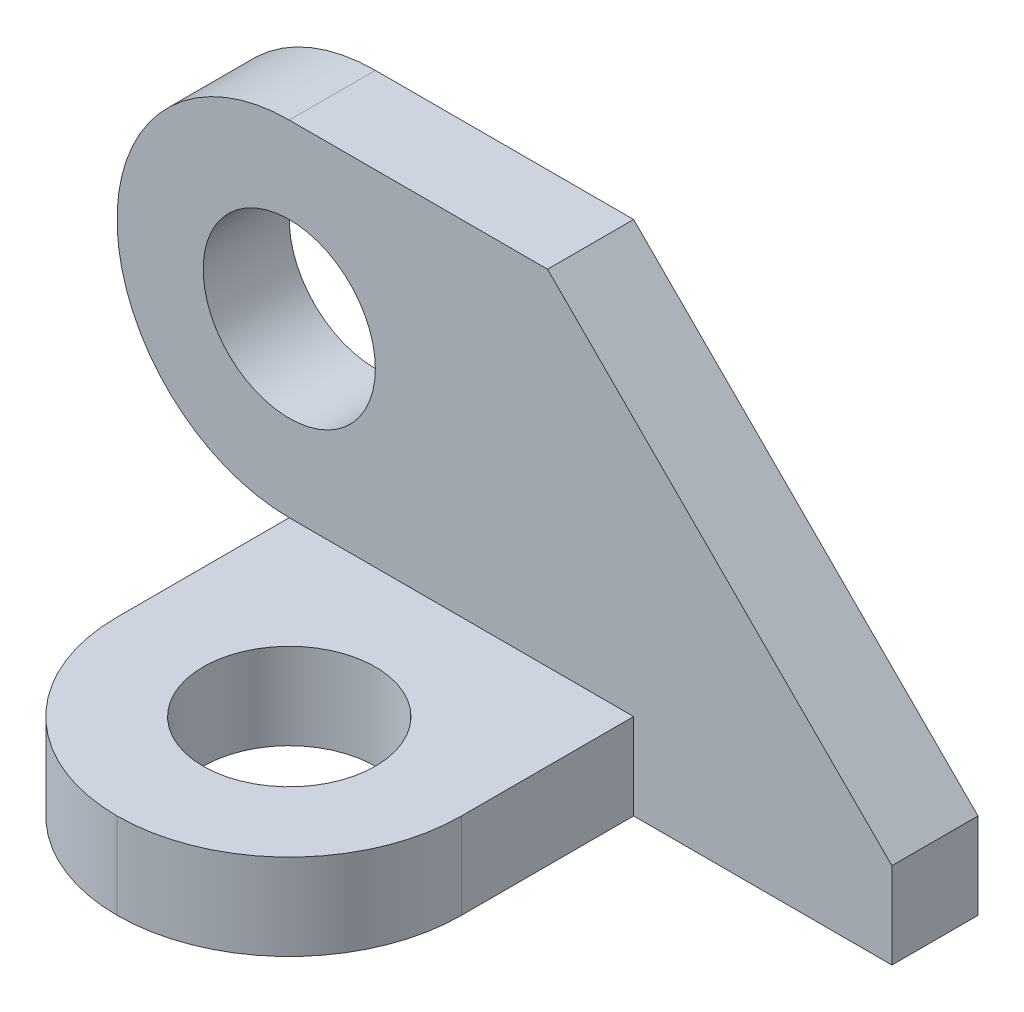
ISO-10303-21;
HEADER;
FILE_DESCRIPTION(('STEP AP214'),'2;1');
FILE_NAME('part.step','',(''),(''),'','','');
FILE_SCHEMA(('AUTOMOTIVE_DESIGN { 1 0 10303 214 1 1 1 1 }'));
ENDSEC;
DATA;
#1=APPLICATION_CONTEXT('core data for automotive mechanical design processes');
#2=APPLICATION_PROTOCOL_DEFINITION('international standard','automotive_design',2000,#1);
#3=PRODUCT_CONTEXT('',#1,'mechanical');
#4=PRODUCT('Part','Part','',(#3));
#5=PRODUCT_RELATED_PRODUCT_CATEGORY('part','',(#4));
#6=PRODUCT_DEFINITION_FORMATION('','',#4);
#7=PRODUCT_DEFINITION_CONTEXT('part definition',#1,'design');
#8=PRODUCT_DEFINITION('design','',#6,#7);
#9=PRODUCT_DEFINITION_SHAPE('','',#8);
#10=(LENGTH_UNIT() NAMED_UNIT(*) SI_UNIT(.MILLI.,.METRE.));
#11=(NAMED_UNIT(*) PLANE_ANGLE_UNIT() SI_UNIT($,.RADIAN.));
#12=(NAMED_UNIT(*) SI_UNIT($,.STERADIAN.) SOLID_ANGLE_UNIT());
#13=UNCERTAINTY_MEASURE_WITH_UNIT(LENGTH_MEASURE(1.E-05),#10,'distance_accuracy_value','');
#14=(GEOMETRIC_REPRESENTATION_CONTEXT(3) GLOBAL_UNCERTAINTY_ASSIGNED_CONTEXT((#13)) GLOBAL_UNIT_ASSIGNED_CONTEXT((#10,
#11,#12)) REPRESENTATION_CONTEXT('',''));
#15=CARTESIAN_POINT('',(0.,0.,0.));
#16=DIRECTION('',(0.,0.,1.));
#17=DIRECTION('',(1.,0.,0.));
#18=AXIS2_PLACEMENT_3D('',#15,#16,#17);
#19=CARTESIAN_POINT('',(0.,30.,0.));
#20=DIRECTION('',(0.,0.,-1.));
#21=DIRECTION('',(-1.,0.,0.));
#22=AXIS2_PLACEMENT_3D('',#19,#20,#21);
#23=PLANE('',#22);
#24=CARTESIAN_POINT('',(0.,30.,0.));
#25=DIRECTION('',(0.,0.,1.));
#26=DIRECTION('',(1.,0.,0.));
#27=AXIS2_PLACEMENT_3D('',#24,#25,#26);
#28=CIRCLE('',#27,10.);
#29=CARTESIAN_POINT('',(10.,30.,0.));
#30=VERTEX_POINT('',#29);
#31=EDGE_CURVE('E167',#30,#30,#28,.T.);
#32=ORIENTED_EDGE('',*,*,#31,.F.);
#33=EDGE_LOOP('',(#32));
#34=FACE_BOUND('',#33,.T.);
#35=DIRECTION('',(-1.,0.,0.));
#36=VECTOR('',#35,1.);
#37=CARTESIAN_POINT('',(0.,10.,0.));
#38=LINE('',#37,#36);
#39=CARTESIAN_POINT('',(40.,10.,0.));
#40=VERTEX_POINT('',#39);
#41=CARTESIAN_POINT('',(0.,10.,0.));
#42=VERTEX_POINT('',#41);
#43=EDGE_CURVE('E108',#40,#42,#38,.T.);
#44=ORIENTED_EDGE('',*,*,#43,.F.);
#45=DIRECTION('',(0.,-1.,0.));
#46=VECTOR('',#45,1.);
#47=CARTESIAN_POINT('',(40.,10.,0.));
#48=LINE('',#47,#46);
#49=CARTESIAN_POINT('',(40.,0.,0.));
#50=VERTEX_POINT('',#49);
#51=EDGE_CURVE('E116',#40,#50,#48,.T.);
#52=ORIENTED_EDGE('',*,*,#51,.T.);
#53=DIRECTION('',(1.,0.,0.));
#54=VECTOR('',#53,1.);
#55=CARTESIAN_POINT('',(70.,0.,0.));
#56=LINE('',#55,#54);
#57=CARTESIAN_POINT('',(70.,0.,0.));
#58=VERTEX_POINT('',#57);
#59=EDGE_CURVE('E122',#50,#58,#56,.T.);
#60=ORIENTED_EDGE('',*,*,#59,.T.);
#61=DIRECTION('',(0.,1.,0.));
#62=VECTOR('',#61,1.);
#63=CARTESIAN_POINT('',(70.,10.,0.));
#64=LINE('',#63,#62);
#65=CARTESIAN_POINT('',(70.,10.,0.));
#66=VERTEX_POINT('',#65);
#67=EDGE_CURVE('E199',#58,#66,#64,.T.);
#68=ORIENTED_EDGE('',*,*,#67,.T.);
#69=DIRECTION('',(-0.707106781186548,0.707106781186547,0.));
#70=VECTOR('',#69,1.);
#71=CARTESIAN_POINT('',(30.,50.,0.));
#72=LINE('',#71,#70);
#73=CARTESIAN_POINT('',(30.,50.,0.));
#74=VERTEX_POINT('',#73);
#75=EDGE_CURVE('E202',#66,#74,#72,.T.);
#76=ORIENTED_EDGE('',*,*,#75,.T.);
#77=DIRECTION('',(-1.,0.,0.));
#78=VECTOR('',#77,1.);
#79=CARTESIAN_POINT('',(0.,50.,0.));
#80=LINE('',#79,#78);
#81=CARTESIAN_POINT('',(0.,50.,0.));
#82=VERTEX_POINT('',#81);
#83=EDGE_CURVE('E205',#74,#82,#80,.T.);
#84=ORIENTED_EDGE('',*,*,#83,.T.);
#85=CARTESIAN_POINT('',(0.,30.,0.));
#86=DIRECTION('',(0.,0.,1.));
#87=DIRECTION('',(-1.,0.,0.));
#88=AXIS2_PLACEMENT_3D('',#85,#86,#87);
#89=CIRCLE('',#88,20.);
#90=EDGE_CURVE('E127',#82,#42,#89,.T.);
#91=ORIENTED_EDGE('',*,*,#90,.T.);
#92=EDGE_LOOP('',(#44,#52,#60,#68,#76,#84,#91));
#93=FACE_BOUND('',#92,.T.);
#94=ADVANCED_FACE('F31',(#34,#93),#23,.F.);
#95=CARTESIAN_POINT('',(70.,0.,-10.));
#96=DIRECTION('',(0.,-1.,0.));
#97=DIRECTION('',(1.,0.,0.));
#98=AXIS2_PLACEMENT_3D('',#95,#96,#97);
#99=PLANE('',#98);
#100=CARTESIAN_POINT('',(20.,0.,20.));
#101=DIRECTION('',(0.,1.,0.));
#102=DIRECTION('',(0.,0.,1.));
#103=AXIS2_PLACEMENT_3D('',#100,#101,#102);
#104=CIRCLE('',#103,10.);
#105=CARTESIAN_POINT('',(20.,0.,30.));
#106=VERTEX_POINT('',#105);
#107=EDGE_CURVE('E157',#106,#106,#104,.T.);
#108=ORIENTED_EDGE('',*,*,#107,.T.);
#109=EDGE_LOOP('',(#108));
#110=FACE_BOUND('',#109,.T.);
#111=DIRECTION('',(0.,0.,-1.));
#112=VECTOR('',#111,1.);
#113=CARTESIAN_POINT('',(40.,0.,0.));
#114=LINE('',#113,#112);
#115=CARTESIAN_POINT('',(40.,0.,20.));
#116=VERTEX_POINT('',#115);
#117=EDGE_CURVE('E119',#116,#50,#114,.T.);
#118=ORIENTED_EDGE('',*,*,#117,.F.);
#119=CARTESIAN_POINT('',(20.,0.,20.));
#120=DIRECTION('',(0.,-1.,0.));
#121=DIRECTION('',(1.,0.,0.));
#122=AXIS2_PLACEMENT_3D('',#119,#120,#121);
#123=CIRCLE('',#122,20.);
#124=CARTESIAN_POINT('',(20.,0.,40.));
#125=VERTEX_POINT('',#124);
#126=EDGE_CURVE('E147',#116,#125,#123,.T.);
#127=ORIENTED_EDGE('',*,*,#126,.T.);
#128=CARTESIAN_POINT('',(20.,0.,20.));
#129=DIRECTION('',(0.,-1.,0.));
#130=DIRECTION('',(1.,0.,0.));
#131=AXIS2_PLACEMENT_3D('',#128,#129,#130);
#132=CIRCLE('',#131,20.);
#133=CARTESIAN_POINT('',(0.,0.,20.));
#134=VERTEX_POINT('',#133);
#135=EDGE_CURVE('E144',#125,#134,#132,.T.);
#136=ORIENTED_EDGE('',*,*,#135,.T.);
#137=DIRECTION('',(0.,0.,1.));
#138=VECTOR('',#137,1.);
#139=CARTESIAN_POINT('',(0.,0.,-10.));
#140=LINE('',#139,#138);
#141=CARTESIAN_POINT('',(0.,0.,-10.));
#142=VERTEX_POINT('',#141);
#143=EDGE_CURVE('E145',#142,#134,#140,.T.);
#144=ORIENTED_EDGE('',*,*,#143,.F.);
#145=DIRECTION('',(1.,0.,0.));
#146=VECTOR('',#145,1.);
#147=CARTESIAN_POINT('',(70.,0.,-10.));
#148=LINE('',#147,#146);
#149=CARTESIAN_POINT('',(70.,0.,-10.));
#150=VERTEX_POINT('',#149);
#151=EDGE_CURVE('E133',#142,#150,#148,.T.);
#152=ORIENTED_EDGE('',*,*,#151,.T.);
#153=DIRECTION('',(0.,0.,1.));
#154=VECTOR('',#153,1.);
#155=CARTESIAN_POINT('',(70.,0.,-10.));
#156=LINE('',#155,#154);
#157=EDGE_CURVE('E188',#150,#58,#156,.T.);
#158=ORIENTED_EDGE('',*,*,#157,.T.);
#159=ORIENTED_EDGE('',*,*,#59,.F.);
#160=EDGE_LOOP('',(#118,#127,#136,#144,#152,#158,#159));
#161=FACE_BOUND('',#160,.T.);
#162=ADVANCED_FACE('F152',(#110,#161),#99,.T.);
#163=CARTESIAN_POINT('',(0.,0.,-10.));
#164=DIRECTION('',(-1.,0.,0.));
#165=DIRECTION('',(0.,0.,1.));
#166=AXIS2_PLACEMENT_3D('',#163,#164,#165);
#167=PLANE('',#166);
#168=ORIENTED_EDGE('',*,*,#143,.T.);
#169=DIRECTION('',(0.,-1.,0.));
#170=VECTOR('',#169,1.);
#171=CARTESIAN_POINT('',(0.,10.,20.));
#172=LINE('',#171,#170);
#173=CARTESIAN_POINT('',(0.,10.,20.));
#174=VERTEX_POINT('',#173);
#175=EDGE_CURVE('E11',#134,#174,#172,.F.);
#176=ORIENTED_EDGE('',*,*,#175,.T.);
#177=DIRECTION('',(0.,0.,1.));
#178=VECTOR('',#177,1.);
#179=CARTESIAN_POINT('',(0.,10.,0.));
#180=LINE('',#179,#178);
#181=EDGE_CURVE('E113',#42,#174,#180,.T.);
#182=ORIENTED_EDGE('',*,*,#181,.F.);
#183=DIRECTION('',(0.,0.,1.));
#184=VECTOR('',#183,1.);
#185=CARTESIAN_POINT('',(0.,10.,-10.));
#186=LINE('',#185,#184);
#187=CARTESIAN_POINT('',(0.,10.,-10.));
#188=VERTEX_POINT('',#187);
#189=EDGE_CURVE('E172',#188,#42,#186,.T.);
#190=ORIENTED_EDGE('',*,*,#189,.F.);
#191=DIRECTION('',(0.,-1.,0.));
#192=VECTOR('',#191,1.);
#193=CARTESIAN_POINT('',(0.,0.,-10.));
#194=LINE('',#193,#192);
#195=EDGE_CURVE('E190',#188,#142,#194,.T.);
#196=ORIENTED_EDGE('',*,*,#195,.T.);
#197=EDGE_LOOP('',(#168,#176,#182,#190,#196));
#198=FACE_BOUND('',#197,.T.);
#199=ADVANCED_FACE('F170',(#198),#167,.T.);
#200=CARTESIAN_POINT('',(0.,30.,-10.));
#201=DIRECTION('',(0.,0.,1.));
#202=DIRECTION('',(1.,0.,0.));
#203=AXIS2_PLACEMENT_3D('',#200,#201,#202);
#204=CYLINDRICAL_SURFACE('',#203,20.);
#205=ORIENTED_EDGE('',*,*,#90,.F.);
#206=DIRECTION('',(0.,0.,1.));
#207=VECTOR('',#206,1.);
#208=CARTESIAN_POINT('',(0.,50.,-10.));
#209=LINE('',#208,#207);
#210=CARTESIAN_POINT('',(0.,50.,-10.));
#211=VERTEX_POINT('',#210);
#212=EDGE_CURVE('E179',#211,#82,#209,.T.);
#213=ORIENTED_EDGE('',*,*,#212,.F.);
#214=CARTESIAN_POINT('',(0.,30.,-10.));
#215=DIRECTION('',(0.,0.,1.));
#216=DIRECTION('',(-1.,0.,0.));
#217=AXIS2_PLACEMENT_3D('',#214,#215,#216);
#218=CIRCLE('',#217,20.);
#219=EDGE_CURVE('E177',#211,#188,#218,.T.);
#220=ORIENTED_EDGE('',*,*,#219,.T.);
#221=ORIENTED_EDGE('',*,*,#189,.T.);
#222=EDGE_LOOP('',(#205,#213,#220,#221));
#223=FACE_BOUND('',#222,.T.);
#224=ADVANCED_FACE('F175',(#223),#204,.T.);
#225=CARTESIAN_POINT('',(0.,50.,-10.));
#226=DIRECTION('',(0.,1.,0.));
#227=DIRECTION('',(0.,0.,1.));
#228=AXIS2_PLACEMENT_3D('',#225,#226,#227);
#229=PLANE('',#228);
#230=ORIENTED_EDGE('',*,*,#83,.F.);
#231=DIRECTION('',(0.,0.,1.));
#232=VECTOR('',#231,1.);
#233=CARTESIAN_POINT('',(30.,50.,-10.));
#234=LINE('',#233,#232);
#235=CARTESIAN_POINT('',(30.,50.,-10.));
#236=VERTEX_POINT('',#235);
#237=EDGE_CURVE('E182',#236,#74,#234,.T.);
#238=ORIENTED_EDGE('',*,*,#237,.F.);
#239=DIRECTION('',(-1.,0.,0.));
#240=VECTOR('',#239,1.);
#241=CARTESIAN_POINT('',(0.,50.,-10.));
#242=LINE('',#241,#240);
#243=EDGE_CURVE('E194',#236,#211,#242,.T.);
#244=ORIENTED_EDGE('',*,*,#243,.T.);
#245=ORIENTED_EDGE('',*,*,#212,.T.);
#246=EDGE_LOOP('',(#230,#238,#244,#245));
#247=FACE_BOUND('',#246,.T.);
#248=ADVANCED_FACE('F218',(#247),#229,.T.);
#249=CARTESIAN_POINT('',(30.,50.,-10.));
#250=DIRECTION('',(0.707106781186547,0.707106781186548,0.));
#251=DIRECTION('',(-0.707106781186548,0.707106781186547,0.));
#252=AXIS2_PLACEMENT_3D('',#249,#250,#251);
#253=PLANE('',#252);
#254=ORIENTED_EDGE('',*,*,#75,.F.);
#255=DIRECTION('',(0.,0.,1.));
#256=VECTOR('',#255,1.);
#257=CARTESIAN_POINT('',(70.,10.,-10.));
#258=LINE('',#257,#256);
#259=CARTESIAN_POINT('',(70.,10.,-10.));
#260=VERTEX_POINT('',#259);
#261=EDGE_CURVE('E187',#260,#66,#258,.T.);
#262=ORIENTED_EDGE('',*,*,#261,.F.);
#263=DIRECTION('',(-0.707106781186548,0.707106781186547,0.));
#264=VECTOR('',#263,1.);
#265=CARTESIAN_POINT('',(30.,50.,-10.));
#266=LINE('',#265,#264);
#267=EDGE_CURVE('E209',#260,#236,#266,.T.);
#268=ORIENTED_EDGE('',*,*,#267,.T.);
#269=ORIENTED_EDGE('',*,*,#237,.T.);
#270=EDGE_LOOP('',(#254,#262,#268,#269));
#271=FACE_BOUND('',#270,.T.);
#272=ADVANCED_FACE('F224',(#271),#253,.T.);
#273=CARTESIAN_POINT('',(70.,10.,-10.));
#274=DIRECTION('',(1.,0.,0.));
#275=DIRECTION('',(0.,0.,-1.));
#276=AXIS2_PLACEMENT_3D('',#273,#274,#275);
#277=PLANE('',#276);
#278=ORIENTED_EDGE('',*,*,#67,.F.);
#279=ORIENTED_EDGE('',*,*,#157,.F.);
#280=DIRECTION('',(0.,1.,0.));
#281=VECTOR('',#280,1.);
#282=CARTESIAN_POINT('',(70.,10.,-10.));
#283=LINE('',#282,#281);
#284=EDGE_CURVE('E206',#150,#260,#283,.T.);
#285=ORIENTED_EDGE('',*,*,#284,.T.);
#286=ORIENTED_EDGE('',*,*,#261,.T.);
#287=EDGE_LOOP('',(#278,#279,#285,#286));
#288=FACE_BOUND('',#287,.T.);
#289=ADVANCED_FACE('F225',(#288),#277,.T.);
#290=CARTESIAN_POINT('',(0.,30.,-10.));
#291=DIRECTION('',(0.,0.,-1.));
#292=DIRECTION('',(-1.,0.,0.));
#293=AXIS2_PLACEMENT_3D('',#290,#291,#292);
#294=PLANE('',#293);
#295=CARTESIAN_POINT('',(0.,30.,-10.));
#296=DIRECTION('',(0.,0.,1.));
#297=DIRECTION('',(1.,0.,0.));
#298=AXIS2_PLACEMENT_3D('',#295,#296,#297);
#299=CIRCLE('',#298,10.);
#300=CARTESIAN_POINT('',(10.,30.,-10.));
#301=VERTEX_POINT('',#300);
#302=EDGE_CURVE('E164',#301,#301,#299,.T.);
#303=ORIENTED_EDGE('',*,*,#302,.T.);
#304=EDGE_LOOP('',(#303));
#305=FACE_BOUND('',#304,.T.);
#306=ORIENTED_EDGE('',*,*,#151,.F.);
#307=ORIENTED_EDGE('',*,*,#195,.F.);
#308=ORIENTED_EDGE('',*,*,#219,.F.);
#309=ORIENTED_EDGE('',*,*,#243,.F.);
#310=ORIENTED_EDGE('',*,*,#267,.F.);
#311=ORIENTED_EDGE('',*,*,#284,.F.);
#312=EDGE_LOOP('',(#306,#307,#308,#309,#310,#311));
#313=FACE_BOUND('',#312,.T.);
#314=ADVANCED_FACE('F221',(#305,#313),#294,.T.);
#315=CARTESIAN_POINT('',(40.,10.,0.));
#316=DIRECTION('',(-1.,0.,0.));
#317=DIRECTION('',(0.,0.,1.));
#318=AXIS2_PLACEMENT_3D('',#315,#316,#317);
#319=PLANE('',#318);
#320=DIRECTION('',(0.,0.,-1.));
#321=VECTOR('',#320,1.);
#322=CARTESIAN_POINT('',(40.,10.,0.));
#323=LINE('',#322,#321);
#324=CARTESIAN_POINT('',(40.,10.,20.));
#325=VERTEX_POINT('',#324);
#326=EDGE_CURVE('E104',#325,#40,#323,.T.);
#327=ORIENTED_EDGE('',*,*,#326,.F.);
#328=DIRECTION('',(0.,-1.,0.));
#329=VECTOR('',#328,1.);
#330=CARTESIAN_POINT('',(40.,10.,20.));
#331=LINE('',#330,#329);
#332=EDGE_CURVE('E142',#325,#116,#331,.T.);
#333=ORIENTED_EDGE('',*,*,#332,.T.);
#334=ORIENTED_EDGE('',*,*,#117,.T.);
#335=ORIENTED_EDGE('',*,*,#51,.F.);
#336=EDGE_LOOP('',(#327,#333,#334,#335));
#337=FACE_BOUND('',#336,.T.);
#338=ADVANCED_FACE('F117',(#337),#319,.F.);
#339=CARTESIAN_POINT('',(0.,10.,40.));
#340=DIRECTION('',(0.,1.,0.));
#341=DIRECTION('',(0.,0.,1.));
#342=AXIS2_PLACEMENT_3D('',#339,#340,#341);
#343=PLANE('',#342);
#344=CARTESIAN_POINT('',(20.,10.,20.));
#345=DIRECTION('',(0.,1.,0.));
#346=DIRECTION('',(0.,0.,1.));
#347=AXIS2_PLACEMENT_3D('',#344,#345,#346);
#348=CIRCLE('',#347,10.);
#349=CARTESIAN_POINT('',(20.,10.,30.));
#350=VERTEX_POINT('',#349);
#351=EDGE_CURVE('E159',#350,#350,#348,.T.);
#352=ORIENTED_EDGE('',*,*,#351,.F.);
#353=EDGE_LOOP('',(#352));
#354=FACE_BOUND('',#353,.T.);
#355=CARTESIAN_POINT('',(20.,10.,20.));
#356=DIRECTION('',(0.,1.,0.));
#357=DIRECTION('',(0.,0.,1.));
#358=AXIS2_PLACEMENT_3D('',#355,#356,#357);
#359=CIRCLE('',#358,20.);
#360=CARTESIAN_POINT('',(20.,10.,40.));
#361=VERTEX_POINT('',#360);
#362=EDGE_CURVE('E47',#174,#361,#359,.T.);
#363=ORIENTED_EDGE('',*,*,#362,.T.);
#364=CARTESIAN_POINT('',(20.,10.,20.));
#365=DIRECTION('',(0.,1.,0.));
#366=DIRECTION('',(0.,0.,1.));
#367=AXIS2_PLACEMENT_3D('',#364,#365,#366);
#368=CIRCLE('',#367,20.);
#369=EDGE_CURVE('E40',#361,#325,#368,.T.);
#370=ORIENTED_EDGE('',*,*,#369,.T.);
#371=ORIENTED_EDGE('',*,*,#326,.T.);
#372=ORIENTED_EDGE('',*,*,#43,.T.);
#373=ORIENTED_EDGE('',*,*,#181,.T.);
#374=EDGE_LOOP('',(#363,#370,#371,#372,#373));
#375=FACE_BOUND('',#374,.T.);
#376=ADVANCED_FACE('F106',(#354,#375),#343,.T.);
#377=CARTESIAN_POINT('',(20.,10.,20.));
#378=DIRECTION('',(0.,1.,0.));
#379=DIRECTION('',(0.,0.,1.));
#380=AXIS2_PLACEMENT_3D('',#377,#378,#379);
#381=CYLINDRICAL_SURFACE('',#380,20.);
#382=DIRECTION('',(0.,-1.,0.));
#383=VECTOR('',#382,1.);
#384=CARTESIAN_POINT('',(20.,0.,40.));
#385=LINE('',#384,#383);
#386=EDGE_CURVE('E35',#361,#125,#385,.T.);
#387=ORIENTED_EDGE('',*,*,#386,.F.);
#388=ORIENTED_EDGE('',*,*,#362,.F.);
#389=ORIENTED_EDGE('',*,*,#175,.F.);
#390=ORIENTED_EDGE('',*,*,#135,.F.);
#391=EDGE_LOOP('',(#387,#388,#389,#390));
#392=FACE_BOUND('',#391,.T.);
#393=ADVANCED_FACE('F33',(#392),#381,.T.);
#394=CARTESIAN_POINT('',(20.,10.,20.));
#395=DIRECTION('',(0.,-1.,0.));
#396=DIRECTION('',(0.,0.,-1.));
#397=AXIS2_PLACEMENT_3D('',#394,#395,#396);
#398=CYLINDRICAL_SURFACE('',#397,20.);
#399=ORIENTED_EDGE('',*,*,#369,.F.);
#400=ORIENTED_EDGE('',*,*,#386,.T.);
#401=ORIENTED_EDGE('',*,*,#126,.F.);
#402=ORIENTED_EDGE('',*,*,#332,.F.);
#403=EDGE_LOOP('',(#399,#400,#401,#402));
#404=FACE_BOUND('',#403,.T.);
#405=ADVANCED_FACE('F156',(#404),#398,.T.);
#406=CARTESIAN_POINT('',(20.,0.,20.));
#407=DIRECTION('',(0.,1.,0.));
#408=DIRECTION('',(0.,0.,1.));
#409=AXIS2_PLACEMENT_3D('',#406,#407,#408);
#410=CYLINDRICAL_SURFACE('',#409,10.);
#411=ORIENTED_EDGE('',*,*,#107,.F.);
#412=EDGE_LOOP('',(#411));
#413=FACE_BOUND('',#412,.T.);
#414=ORIENTED_EDGE('',*,*,#351,.T.);
#415=EDGE_LOOP('',(#414));
#416=FACE_BOUND('',#415,.T.);
#417=ADVANCED_FACE('F300',(#413,#416),#410,.F.);
#418=CARTESIAN_POINT('',(0.,30.,-10.));
#419=DIRECTION('',(0.,0.,1.));
#420=DIRECTION('',(1.,0.,0.));
#421=AXIS2_PLACEMENT_3D('',#418,#419,#420);
#422=CYLINDRICAL_SURFACE('',#421,10.);
#423=ORIENTED_EDGE('',*,*,#302,.F.);
#424=EDGE_LOOP('',(#423));
#425=FACE_BOUND('',#424,.T.);
#426=ORIENTED_EDGE('',*,*,#31,.T.);
#427=EDGE_LOOP('',(#426));
#428=FACE_BOUND('',#427,.T.);
#429=ADVANCED_FACE('F321',(#425,#428),#422,.F.);
#430=CLOSED_SHELL('',(#94,#162,#199,#224,#248,#272,#289,#314,#338,#376,#393,#405,#417,#429));
#431=MANIFOLD_SOLID_BREP('B2',#430);
#432=ADVANCED_BREP_SHAPE_REPRESENTATION('',(#18,#431),#14);
#433=SHAPE_DEFINITION_REPRESENTATION(#9,#432);
ENDSEC;
END-ISO-10303-21;
